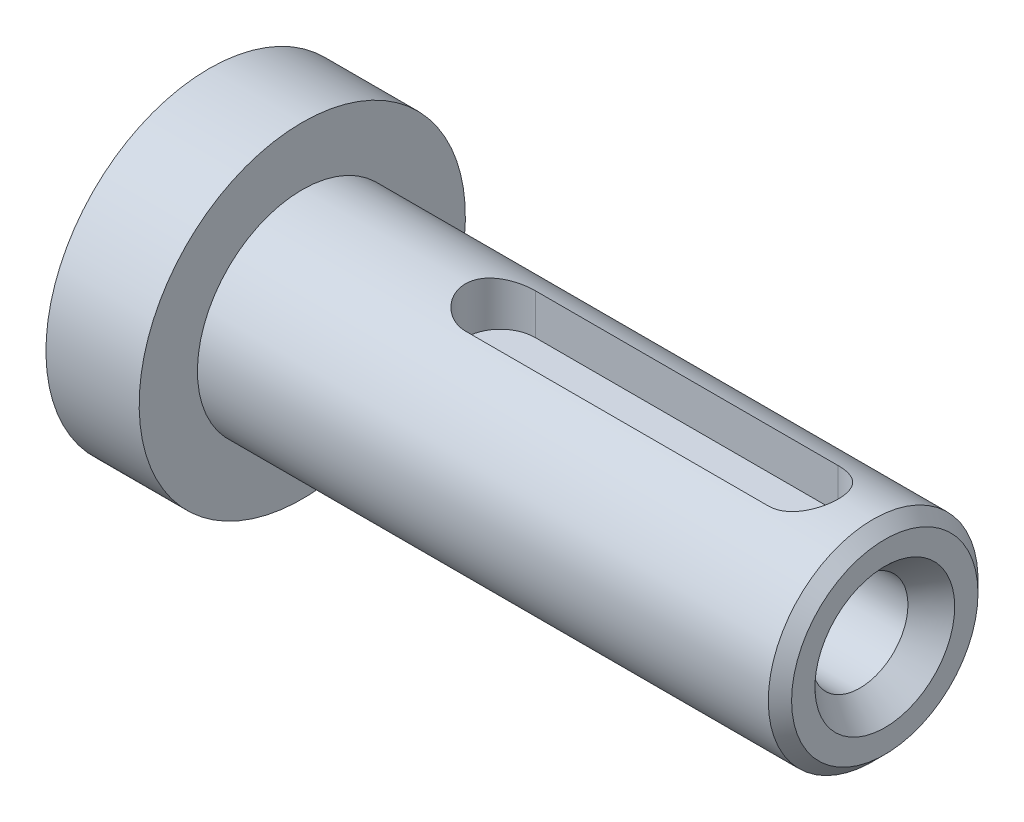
ISO-10303-21;
HEADER;
FILE_DESCRIPTION(('STEP AP214'),'2;1');
FILE_NAME('part.step','',(''),(''),'','','');
FILE_SCHEMA(('AUTOMOTIVE_DESIGN { 1 0 10303 214 1 1 1 1 }'));
ENDSEC;
DATA;
#1=APPLICATION_CONTEXT('core data for automotive mechanical design processes');
#2=APPLICATION_PROTOCOL_DEFINITION('international standard','automotive_design',2000,#1);
#3=PRODUCT_CONTEXT('',#1,'mechanical');
#4=PRODUCT('Part','Part','',(#3));
#5=PRODUCT_RELATED_PRODUCT_CATEGORY('part','',(#4));
#6=PRODUCT_DEFINITION_FORMATION('','',#4);
#7=PRODUCT_DEFINITION_CONTEXT('part definition',#1,'design');
#8=PRODUCT_DEFINITION('design','',#6,#7);
#9=PRODUCT_DEFINITION_SHAPE('','',#8);
#10=(LENGTH_UNIT() NAMED_UNIT(*) SI_UNIT(.MILLI.,.METRE.));
#11=(NAMED_UNIT(*) PLANE_ANGLE_UNIT() SI_UNIT($,.RADIAN.));
#12=(NAMED_UNIT(*) SI_UNIT($,.STERADIAN.) SOLID_ANGLE_UNIT());
#13=UNCERTAINTY_MEASURE_WITH_UNIT(LENGTH_MEASURE(1.E-05),#10,'distance_accuracy_value','');
#14=(GEOMETRIC_REPRESENTATION_CONTEXT(3) GLOBAL_UNCERTAINTY_ASSIGNED_CONTEXT((#13)) GLOBAL_UNIT_ASSIGNED_CONTEXT((#10,
#11,#12)) REPRESENTATION_CONTEXT('',''));
#15=CARTESIAN_POINT('',(0.,0.,0.));
#16=DIRECTION('',(0.,0.,1.));
#17=DIRECTION('',(1.,0.,0.));
#18=AXIS2_PLACEMENT_3D('',#15,#16,#17);
#19=CARTESIAN_POINT('',(13.9999999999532,0.,0.));
#20=DIRECTION('',(1.,0.,0.));
#21=DIRECTION('',(0.,0.,-1.));
#22=AXIS2_PLACEMENT_3D('',#19,#20,#21);
#23=CONICAL_SURFACE('',#22,2.06699999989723,1.02974425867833);
#24=CARTESIAN_POINT('',(12.7580211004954,0.,-5.6843418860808E-11));
#25=VERTEX_POINT('',#24);
#26=VERTEX_LOOP('',#25);
#27=FACE_BOUND('',#26,.T.);
#28=CARTESIAN_POINT('',(14.,0.,0.));
#29=DIRECTION('',(1.,0.,0.));
#30=DIRECTION('',(0.,1.,0.));
#31=AXIS2_PLACEMENT_3D('',#28,#29,#30);
#32=CIRCLE('',#31,2.067);
#33=CARTESIAN_POINT('',(14.,2.067,0.));
#34=VERTEX_POINT('',#33);
#35=EDGE_CURVE('E70',#34,#34,#32,.T.);
#36=ORIENTED_EDGE('',*,*,#35,.T.);
#37=EDGE_LOOP('',(#36));
#38=FACE_BOUND('',#37,.T.);
#39=ADVANCED_FACE('F16',(#27,#38),#23,.F.);
#40=CARTESIAN_POINT('',(21.5,0.,0.));
#41=DIRECTION('',(1.,0.,0.));
#42=DIRECTION('',(0.,1.,0.));
#43=AXIS2_PLACEMENT_3D('',#40,#41,#42);
#44=CYLINDRICAL_SURFACE('',#43,2.067);
#45=CARTESIAN_POINT('',(27.9267062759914,0.,0.));
#46=DIRECTION('',(1.,0.,0.));
#47=DIRECTION('',(0.,0.,-1.));
#48=AXIS2_PLACEMENT_3D('',#45,#46,#47);
#49=CIRCLE('',#48,2.06700000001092);
#50=CARTESIAN_POINT('',(27.9267062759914,0.,-2.06700000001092));
#51=VERTEX_POINT('',#50);
#52=EDGE_CURVE('E72',#51,#51,#49,.T.);
#53=ORIENTED_EDGE('',*,*,#52,.T.);
#54=EDGE_LOOP('',(#53));
#55=FACE_BOUND('',#54,.T.);
#56=ORIENTED_EDGE('',*,*,#35,.F.);
#57=EDGE_LOOP('',(#56));
#58=FACE_BOUND('',#57,.T.);
#59=ADVANCED_FACE('F66',(#55,#58),#44,.F.);
#60=CARTESIAN_POINT('',(28.9999999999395,0.,0.));
#61=DIRECTION('',(1.,0.,0.));
#62=DIRECTION('',(0.,0.,-1.));
#63=AXIS2_PLACEMENT_3D('',#60,#61,#62);
#64=CONICAL_SURFACE('',#63,2.9999999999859,0.715584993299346);
#65=CARTESIAN_POINT('',(28.9999999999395,0.,0.));
#66=DIRECTION('',(1.,0.,0.));
#67=DIRECTION('',(0.,0.,-1.));
#68=AXIS2_PLACEMENT_3D('',#65,#66,#67);
#69=CIRCLE('',#68,2.9999999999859);
#70=CARTESIAN_POINT('',(28.9999999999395,0.,-2.9999999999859));
#71=VERTEX_POINT('',#70);
#72=EDGE_CURVE('E21',#71,#71,#69,.F.);
#73=ORIENTED_EDGE('',*,*,#72,.F.);
#74=EDGE_LOOP('',(#73));
#75=FACE_BOUND('',#74,.T.);
#76=ORIENTED_EDGE('',*,*,#52,.F.);
#77=EDGE_LOOP('',(#76));
#78=FACE_BOUND('',#77,.T.);
#79=ADVANCED_FACE('F175',(#75,#78),#64,.F.);
#80=CARTESIAN_POINT('',(0.,3.5,0.));
#81=DIRECTION('',(-1.,0.,0.));
#82=DIRECTION('',(0.,-1.,0.));
#83=AXIS2_PLACEMENT_3D('',#80,#81,#82);
#84=PLANE('',#83);
#85=CARTESIAN_POINT('',(0.,0.,0.));
#86=DIRECTION('',(1.,0.,0.));
#87=DIRECTION('',(0.,1.,0.));
#88=AXIS2_PLACEMENT_3D('',#85,#86,#87);
#89=CIRCLE('',#88,7.);
#90=CARTESIAN_POINT('',(0.,7.,0.));
#91=VERTEX_POINT('',#90);
#92=EDGE_CURVE('E127',#91,#91,#89,.T.);
#93=ORIENTED_EDGE('',*,*,#92,.F.);
#94=EDGE_LOOP('',(#93));
#95=FACE_BOUND('',#94,.T.);
#96=ADVANCED_FACE('F172',(#95),#84,.T.);
#97=CARTESIAN_POINT('',(19.,2.5,0.));
#98=DIRECTION('',(0.,1.,0.));
#99=DIRECTION('',(0.,0.,1.));
#100=AXIS2_PLACEMENT_3D('',#97,#98,#99);
#101=PLANE('',#100);
#102=DIRECTION('',(1.,0.,0.));
#103=VECTOR('',#102,1.);
#104=CARTESIAN_POINT('',(12.5,2.5,1.5));
#105=LINE('',#104,#103);
#106=CARTESIAN_POINT('',(12.5,2.5,1.5));
#107=VERTEX_POINT('',#106);
#108=CARTESIAN_POINT('',(25.5,2.5,1.5));
#109=VERTEX_POINT('',#108);
#110=EDGE_CURVE('E129',#107,#109,#105,.T.);
#111=ORIENTED_EDGE('',*,*,#110,.T.);
#112=CARTESIAN_POINT('',(25.5,2.5,0.));
#113=DIRECTION('',(0.,-1.,0.));
#114=DIRECTION('',(0.,0.,-1.));
#115=AXIS2_PLACEMENT_3D('',#112,#113,#114);
#116=CIRCLE('',#115,1.5);
#117=CARTESIAN_POINT('',(25.5,2.5,-1.5));
#118=VERTEX_POINT('',#117);
#119=EDGE_CURVE('E123',#109,#118,#116,.F.);
#120=ORIENTED_EDGE('',*,*,#119,.T.);
#121=DIRECTION('',(-1.,0.,0.));
#122=VECTOR('',#121,1.);
#123=CARTESIAN_POINT('',(25.5,2.5,-1.5));
#124=LINE('',#123,#122);
#125=CARTESIAN_POINT('',(12.5,2.5,-1.5));
#126=VERTEX_POINT('',#125);
#127=EDGE_CURVE('E58',#118,#126,#124,.T.);
#128=ORIENTED_EDGE('',*,*,#127,.T.);
#129=CARTESIAN_POINT('',(12.5,2.5,0.));
#130=DIRECTION('',(0.,-1.,0.));
#131=DIRECTION('',(0.,0.,-1.));
#132=AXIS2_PLACEMENT_3D('',#129,#130,#131);
#133=CIRCLE('',#132,1.5);
#134=EDGE_CURVE('E60',#126,#107,#133,.F.);
#135=ORIENTED_EDGE('',*,*,#134,.T.);
#136=EDGE_LOOP('',(#111,#120,#128,#135));
#137=FACE_BOUND('',#136,.T.);
#138=ADVANCED_FACE('F153',(#137),#101,.T.);
#139=CARTESIAN_POINT('',(29.,2.25000000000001,0.));
#140=DIRECTION('',(1.,0.,0.));
#141=DIRECTION('',(0.,0.,-1.));
#142=AXIS2_PLACEMENT_3D('',#139,#140,#141);
#143=PLANE('',#142);
#144=CARTESIAN_POINT('',(28.9999999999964,0.,0.));
#145=DIRECTION('',(-1.,0.,0.));
#146=DIRECTION('',(0.,0.,1.));
#147=AXIS2_PLACEMENT_3D('',#144,#145,#146);
#148=CIRCLE('',#147,4.0000000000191);
#149=CARTESIAN_POINT('',(28.9999999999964,0.,4.0000000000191));
#150=VERTEX_POINT('',#149);
#151=EDGE_CURVE('E118',#150,#150,#148,.T.);
#152=ORIENTED_EDGE('',*,*,#151,.F.);
#153=EDGE_LOOP('',(#152));
#154=FACE_BOUND('',#153,.T.);
#155=ORIENTED_EDGE('',*,*,#72,.T.);
#156=EDGE_LOOP('',(#155));
#157=FACE_BOUND('',#156,.T.);
#158=ADVANCED_FACE('F166',(#154,#157),#143,.T.);
#159=CARTESIAN_POINT('',(12.5,4.5,1.5));
#160=DIRECTION('',(0.,0.,1.));
#161=DIRECTION('',(0.,-1.,0.));
#162=AXIS2_PLACEMENT_3D('',#159,#160,#161);
#163=PLANE('',#162);
#164=DIRECTION('',(0.,-1.,0.));
#165=VECTOR('',#164,1.);
#166=CARTESIAN_POINT('',(25.5,4.5,1.5));
#167=LINE('',#166,#165);
#168=CARTESIAN_POINT('',(25.5,4.24264068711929,1.5));
#169=VERTEX_POINT('',#168);
#170=EDGE_CURVE('E125',#169,#109,#167,.T.);
#171=ORIENTED_EDGE('',*,*,#170,.T.);
#172=ORIENTED_EDGE('',*,*,#110,.F.);
#173=DIRECTION('',(0.,-1.,0.));
#174=VECTOR('',#173,1.);
#175=CARTESIAN_POINT('',(12.5,4.5,1.5));
#176=LINE('',#175,#174);
#177=CARTESIAN_POINT('',(12.5,4.24264068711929,1.5));
#178=VERTEX_POINT('',#177);
#179=EDGE_CURVE('E126',#107,#178,#176,.F.);
#180=ORIENTED_EDGE('',*,*,#179,.T.);
#181=DIRECTION('',(1.,0.,0.));
#182=VECTOR('',#181,1.);
#183=CARTESIAN_POINT('',(16.5,4.24264068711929,1.5));
#184=LINE('',#183,#182);
#185=EDGE_CURVE('E115',#169,#178,#184,.F.);
#186=ORIENTED_EDGE('',*,*,#185,.F.);
#187=EDGE_LOOP('',(#171,#172,#180,#186));
#188=FACE_BOUND('',#187,.T.);
#189=ADVANCED_FACE('F148',(#188),#163,.F.);
#190=CARTESIAN_POINT('',(2.,0.,0.));
#191=DIRECTION('',(1.,0.,0.));
#192=DIRECTION('',(0.,1.,0.));
#193=AXIS2_PLACEMENT_3D('',#190,#191,#192);
#194=CYLINDRICAL_SURFACE('',#193,7.);
#195=CARTESIAN_POINT('',(4.,0.,0.));
#196=DIRECTION('',(1.,0.,0.));
#197=DIRECTION('',(0.,1.,0.));
#198=AXIS2_PLACEMENT_3D('',#195,#196,#197);
#199=CIRCLE('',#198,7.);
#200=CARTESIAN_POINT('',(4.,7.,0.));
#201=VERTEX_POINT('',#200);
#202=EDGE_CURVE('E111',#201,#201,#199,.T.);
#203=ORIENTED_EDGE('',*,*,#202,.F.);
#204=EDGE_LOOP('',(#203));
#205=FACE_BOUND('',#204,.T.);
#206=ORIENTED_EDGE('',*,*,#92,.T.);
#207=EDGE_LOOP('',(#206));
#208=FACE_BOUND('',#207,.T.);
#209=ADVANCED_FACE('F157',(#205,#208),#194,.T.);
#210=CARTESIAN_POINT('',(12.5,4.5,0.));
#211=DIRECTION('',(0.,-1.,0.));
#212=DIRECTION('',(0.,0.,-1.));
#213=AXIS2_PLACEMENT_3D('',#210,#211,#212);
#214=CYLINDRICAL_SURFACE('',#213,1.5);
#215=CARTESIAN_POINT('',(12.5,4.24264068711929,1.5));
#216=CARTESIAN_POINT('',(12.459064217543,4.24263663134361,1.50000112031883));
#217=CARTESIAN_POINT('',(12.4181493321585,4.24323390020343,1.49832318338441));
#218=CARTESIAN_POINT('',(12.3366369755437,4.24558991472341,1.49163839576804));
#219=CARTESIAN_POINT('',(12.2960394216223,4.24734834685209,1.48663244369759));
#220=CARTESIAN_POINT('',(12.175411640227,4.25428639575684,1.46671597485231));
#221=CARTESIAN_POINT('',(12.0962286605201,4.26112939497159,1.4469063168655));
#222=CARTESIAN_POINT('',(11.9425611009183,4.27842124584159,1.39493725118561));
#223=CARTESIAN_POINT('',(11.8680740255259,4.28886816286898,1.36278446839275));
#224=CARTESIAN_POINT('',(11.7254882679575,4.31218218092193,1.28710854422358));
#225=CARTESIAN_POINT('',(11.6573933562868,4.32505069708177,1.24357874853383));
#226=CARTESIAN_POINT('',(11.5269254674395,4.35231599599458,1.14458163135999));
#227=CARTESIAN_POINT('',(11.4648385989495,4.36675064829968,1.08874777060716));
#228=CARTESIAN_POINT('',(11.3507000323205,4.39520526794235,0.967493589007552));
#229=CARTESIAN_POINT('',(11.2986518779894,4.40922508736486,0.902069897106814));
#230=CARTESIAN_POINT('',(11.2047588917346,4.43571449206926,0.761374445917));
#231=CARTESIAN_POINT('',(11.1632208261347,4.44813318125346,0.685887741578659));
#232=CARTESIAN_POINT('',(11.0935845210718,4.46955244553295,0.528559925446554));
#233=CARTESIAN_POINT('',(11.0654697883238,4.47855721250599,0.446726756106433));
#234=CARTESIAN_POINT('',(11.0298143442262,4.49012907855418,0.303780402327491));
#235=CARTESIAN_POINT('',(11.0186570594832,4.49380993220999,0.243634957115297));
#236=CARTESIAN_POINT('',(11.0037488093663,4.4987462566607,0.122333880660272));
#237=CARTESIAN_POINT('',(10.999997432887,4.50000186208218,0.0611783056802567));
#238=CARTESIAN_POINT('',(11.0000034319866,4.49999751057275,-0.0817895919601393));
#239=CARTESIAN_POINT('',(11.0067163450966,4.49774753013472,-0.163619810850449));
#240=CARTESIAN_POINT('',(11.0333277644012,4.48898373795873,-0.324909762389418));
#241=CARTESIAN_POINT('',(11.0532374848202,4.48246629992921,-0.404367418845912));
#242=CARTESIAN_POINT('',(11.1054806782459,4.4658789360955,-0.558502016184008));
#243=CARTESIAN_POINT('',(11.1377894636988,4.45581607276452,-0.63318811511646));
#244=CARTESIAN_POINT('',(11.213816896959,4.43316524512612,-0.77607095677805));
#245=CARTESIAN_POINT('',(11.2575364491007,4.42057708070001,-0.844267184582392));
#246=CARTESIAN_POINT('',(11.3567371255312,4.39371181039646,-0.974610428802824));
#247=CARTESIAN_POINT('',(11.412543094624,4.37939421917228,-1.03650182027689));
#248=CARTESIAN_POINT('',(11.5336474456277,4.35090550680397,-1.15024615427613));
#249=CARTESIAN_POINT('',(11.5989484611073,4.33673442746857,-1.20209630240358));
#250=CARTESIAN_POINT('',(11.7395008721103,4.30969530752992,-1.29575381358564));
#251=CARTESIAN_POINT('',(11.8149864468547,4.29687715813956,-1.33722519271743));
#252=CARTESIAN_POINT('',(11.9723298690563,4.27462222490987,-1.40674971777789));
#253=CARTESIAN_POINT('',(12.0541811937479,4.26518203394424,-1.43481639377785));
#254=CARTESIAN_POINT('',(12.19699794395,4.25304078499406,-1.47033712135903));
#255=CARTESIAN_POINT('',(12.2569820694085,4.24917238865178,-1.48143226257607));
#256=CARTESIAN_POINT('',(12.3779634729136,4.24395805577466,-1.49627411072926));
#257=CARTESIAN_POINT('',(12.4389608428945,4.2426123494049,-1.5000201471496));
#258=CARTESIAN_POINT('',(12.5,4.24264068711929,-1.5));
#259=B_SPLINE_CURVE_WITH_KNOTS('',3,(#215,#216,#217,#218,#219,#220,#221,#222,#223,#224,#225,
#226,#227,#228,#229,#230,#231,#232,#233,#234,#235,#236,#237,#238,#239,#240,#241,#242,#243,#244,
#245,#246,#247,#248,#249,#250,#251,#252,#253,#254,#255,#256,#257,#258),.UNSPECIFIED.,.F.,.F.,(4,
2,2,2,2,2,2,2,2,2,2,2,2,2,2,2,2,2,2,2,2,4),(0.,0.122727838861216,0.245422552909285,
0.489871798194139,0.734190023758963,0.978651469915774,1.23172549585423,1.48488869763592,
1.74475735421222,2.0043058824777,2.18767918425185,2.37104230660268,2.61618140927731,
2.86152909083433,3.10639077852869,3.35127187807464,3.60380525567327,3.85640881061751,
4.11635987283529,4.37604799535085,4.55894346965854,4.7418556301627),.UNSPECIFIED.);
#260=CARTESIAN_POINT('',(12.5,4.24264068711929,-1.5));
#261=VERTEX_POINT('',#260);
#262=EDGE_CURVE('E85',#178,#261,#259,.T.);
#263=ORIENTED_EDGE('',*,*,#262,.F.);
#264=ORIENTED_EDGE('',*,*,#179,.F.);
#265=ORIENTED_EDGE('',*,*,#134,.F.);
#266=DIRECTION('',(0.,1.,0.));
#267=VECTOR('',#266,1.);
#268=CARTESIAN_POINT('',(12.5,4.5,-1.5));
#269=LINE('',#268,#267);
#270=EDGE_CURVE('E136',#126,#261,#269,.T.);
#271=ORIENTED_EDGE('',*,*,#270,.T.);
#272=EDGE_LOOP('',(#263,#264,#265,#271));
#273=FACE_BOUND('',#272,.T.);
#274=ADVANCED_FACE('F155',(#273),#214,.F.);
#275=CARTESIAN_POINT('',(25.5,4.5,-1.5));
#276=DIRECTION('',(0.,0.,-1.));
#277=DIRECTION('',(-1.,0.,0.));
#278=AXIS2_PLACEMENT_3D('',#275,#276,#277);
#279=PLANE('',#278);
#280=ORIENTED_EDGE('',*,*,#270,.F.);
#281=ORIENTED_EDGE('',*,*,#127,.F.);
#282=DIRECTION('',(0.,-1.,0.));
#283=VECTOR('',#282,1.);
#284=CARTESIAN_POINT('',(25.5,4.5,-1.5));
#285=LINE('',#284,#283);
#286=CARTESIAN_POINT('',(25.5,4.24264068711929,-1.5));
#287=VERTEX_POINT('',#286);
#288=EDGE_CURVE('E36',#118,#287,#285,.F.);
#289=ORIENTED_EDGE('',*,*,#288,.T.);
#290=DIRECTION('',(1.,0.,0.));
#291=VECTOR('',#290,1.);
#292=CARTESIAN_POINT('',(16.5,4.24264068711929,-1.5));
#293=LINE('',#292,#291);
#294=EDGE_CURVE('E84',#261,#287,#293,.T.);
#295=ORIENTED_EDGE('',*,*,#294,.F.);
#296=EDGE_LOOP('',(#280,#281,#289,#295));
#297=FACE_BOUND('',#296,.T.);
#298=ADVANCED_FACE('F97',(#297),#279,.F.);
#299=CARTESIAN_POINT('',(25.5,4.5,0.));
#300=DIRECTION('',(0.,-1.,0.));
#301=DIRECTION('',(0.,0.,-1.));
#302=AXIS2_PLACEMENT_3D('',#299,#300,#301);
#303=CYLINDRICAL_SURFACE('',#302,1.5);
#304=ORIENTED_EDGE('',*,*,#288,.F.);
#305=ORIENTED_EDGE('',*,*,#119,.F.);
#306=ORIENTED_EDGE('',*,*,#170,.F.);
#307=CARTESIAN_POINT('',(25.5,4.24264068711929,-1.5));
#308=CARTESIAN_POINT('',(25.540935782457,4.24263663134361,-1.50000112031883));
#309=CARTESIAN_POINT('',(25.5818506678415,4.24323390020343,-1.49832318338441));
#310=CARTESIAN_POINT('',(25.6633630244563,4.24558991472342,-1.49163839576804));
#311=CARTESIAN_POINT('',(25.7039605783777,4.24734834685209,-1.48663244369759));
#312=CARTESIAN_POINT('',(25.824588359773,4.25428639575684,-1.46671597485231));
#313=CARTESIAN_POINT('',(25.9037713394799,4.2611293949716,-1.4469063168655));
#314=CARTESIAN_POINT('',(26.0574388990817,4.27842124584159,-1.39493725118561));
#315=CARTESIAN_POINT('',(26.1319259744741,4.28886816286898,-1.36278446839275));
#316=CARTESIAN_POINT('',(26.2745117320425,4.31218218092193,-1.28710854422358));
#317=CARTESIAN_POINT('',(26.3426066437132,4.32505069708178,-1.24357874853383));
#318=CARTESIAN_POINT('',(26.4730745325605,4.35231599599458,-1.14458163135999));
#319=CARTESIAN_POINT('',(26.5351614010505,4.36675064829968,-1.08874777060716));
#320=CARTESIAN_POINT('',(26.6492999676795,4.39520526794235,-0.967493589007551));
#321=CARTESIAN_POINT('',(26.7013481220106,4.40922508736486,-0.902069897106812));
#322=CARTESIAN_POINT('',(26.7952411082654,4.43571449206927,-0.761374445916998));
#323=CARTESIAN_POINT('',(26.8367791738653,4.44813318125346,-0.685887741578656));
#324=CARTESIAN_POINT('',(26.9064154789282,4.46955244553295,-0.528559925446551));
#325=CARTESIAN_POINT('',(26.9345302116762,4.47855721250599,-0.44672675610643));
#326=CARTESIAN_POINT('',(26.9701856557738,4.49012907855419,-0.303780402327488));
#327=CARTESIAN_POINT('',(26.9813429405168,4.49380993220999,-0.243634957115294));
#328=CARTESIAN_POINT('',(26.9962511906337,4.4987462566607,-0.122333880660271));
#329=CARTESIAN_POINT('',(27.000002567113,4.50000186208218,-0.0611783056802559));
#330=CARTESIAN_POINT('',(26.9999965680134,4.49999751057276,0.0817895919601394));
#331=CARTESIAN_POINT('',(26.9932836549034,4.49774753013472,0.163619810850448));
#332=CARTESIAN_POINT('',(26.9666722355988,4.48898373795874,0.324909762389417));
#333=CARTESIAN_POINT('',(26.9467625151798,4.48246629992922,0.404367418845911));
#334=CARTESIAN_POINT('',(26.8945193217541,4.4658789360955,0.558502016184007));
#335=CARTESIAN_POINT('',(26.8622105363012,4.45581607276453,0.633188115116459));
#336=CARTESIAN_POINT('',(26.786183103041,4.43316524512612,0.776070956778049));
#337=CARTESIAN_POINT('',(26.7424635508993,4.42057708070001,0.844267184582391));
#338=CARTESIAN_POINT('',(26.6432628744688,4.39371181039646,0.974610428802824));
#339=CARTESIAN_POINT('',(26.587456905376,4.37939421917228,1.03650182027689));
#340=CARTESIAN_POINT('',(26.4663525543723,4.35090550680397,1.15024615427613));
#341=CARTESIAN_POINT('',(26.4010515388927,4.33673442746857,1.20209630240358));
#342=CARTESIAN_POINT('',(26.2604991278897,4.30969530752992,1.29575381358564));
#343=CARTESIAN_POINT('',(26.1850135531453,4.29687715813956,1.33722519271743));
#344=CARTESIAN_POINT('',(26.0276701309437,4.27462222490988,1.4067497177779));
#345=CARTESIAN_POINT('',(25.9458188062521,4.26518203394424,1.43481639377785));
#346=CARTESIAN_POINT('',(25.80300205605,4.25304078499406,1.47033712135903));
#347=CARTESIAN_POINT('',(25.7430179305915,4.24917238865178,1.48143226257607));
#348=CARTESIAN_POINT('',(25.6220365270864,4.24395805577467,1.49627411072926));
#349=CARTESIAN_POINT('',(25.5610391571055,4.24261234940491,1.5000201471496));
#350=CARTESIAN_POINT('',(25.5,4.24264068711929,1.5));
#351=B_SPLINE_CURVE_WITH_KNOTS('',3,(#307,#308,#309,#310,#311,#312,#313,#314,#315,#316,#317,
#318,#319,#320,#321,#322,#323,#324,#325,#326,#327,#328,#329,#330,#331,#332,#333,#334,#335,#336,
#337,#338,#339,#340,#341,#342,#343,#344,#345,#346,#347,#348,#349,#350),.UNSPECIFIED.,.F.,.F.,(4,
2,2,2,2,2,2,2,2,2,2,2,2,2,2,2,2,2,2,2,2,4),(0.,0.122727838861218,0.245422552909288,
0.489871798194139,0.734190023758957,0.978651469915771,1.23172549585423,1.48488869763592,
1.74475735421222,2.0043058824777,2.18767918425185,2.37104230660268,2.6161814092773,
2.86152909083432,3.10639077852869,3.35127187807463,3.60380525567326,3.85640881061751,
4.11635987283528,4.37604799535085,4.55894346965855,4.7418556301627),.UNSPECIFIED.);
#352=EDGE_CURVE('E78',#287,#169,#351,.T.);
#353=ORIENTED_EDGE('',*,*,#352,.F.);
#354=EDGE_LOOP('',(#304,#305,#306,#353));
#355=FACE_BOUND('',#354,.T.);
#356=ADVANCED_FACE('F91',(#355),#303,.F.);
#357=CARTESIAN_POINT('',(28.500000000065,0.,0.));
#358=DIRECTION('',(-1.,0.,0.));
#359=DIRECTION('',(0.,0.,1.));
#360=AXIS2_PLACEMENT_3D('',#357,#358,#359);
#361=CONICAL_SURFACE('',#360,4.49999999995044,0.785398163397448);
#362=CARTESIAN_POINT('',(28.5,0.,0.));
#363=DIRECTION('',(1.,0.,0.));
#364=DIRECTION('',(0.,1.,0.));
#365=AXIS2_PLACEMENT_3D('',#362,#363,#364);
#366=CIRCLE('',#365,4.5);
#367=CARTESIAN_POINT('',(28.5,4.50000000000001,0.));
#368=VERTEX_POINT('',#367);
#369=EDGE_CURVE('E27',#368,#368,#366,.F.);
#370=ORIENTED_EDGE('',*,*,#369,.F.);
#371=EDGE_LOOP('',(#370));
#372=FACE_BOUND('',#371,.T.);
#373=ORIENTED_EDGE('',*,*,#151,.T.);
#374=EDGE_LOOP('',(#373));
#375=FACE_BOUND('',#374,.T.);
#376=ADVANCED_FACE('F96',(#372,#375),#361,.T.);
#377=CARTESIAN_POINT('',(4.,5.75,0.));
#378=DIRECTION('',(1.,0.,0.));
#379=DIRECTION('',(0.,0.,-1.));
#380=AXIS2_PLACEMENT_3D('',#377,#378,#379);
#381=PLANE('',#380);
#382=ORIENTED_EDGE('',*,*,#202,.T.);
#383=EDGE_LOOP('',(#382));
#384=FACE_BOUND('',#383,.T.);
#385=CARTESIAN_POINT('',(4.,0.,0.));
#386=DIRECTION('',(1.,0.,0.));
#387=DIRECTION('',(0.,1.,0.));
#388=AXIS2_PLACEMENT_3D('',#385,#386,#387);
#389=CIRCLE('',#388,4.5);
#390=CARTESIAN_POINT('',(4.,4.5,0.));
#391=VERTEX_POINT('',#390);
#392=EDGE_CURVE('E10',#391,#391,#389,.T.);
#393=ORIENTED_EDGE('',*,*,#392,.F.);
#394=EDGE_LOOP('',(#393));
#395=FACE_BOUND('',#394,.T.);
#396=ADVANCED_FACE('F100',(#384,#395),#381,.T.);
#397=CARTESIAN_POINT('',(16.5,0.,0.));
#398=DIRECTION('',(1.,0.,0.));
#399=DIRECTION('',(0.,1.,0.));
#400=AXIS2_PLACEMENT_3D('',#397,#398,#399);
#401=CYLINDRICAL_SURFACE('',#400,4.5);
#402=ORIENTED_EDGE('',*,*,#185,.T.);
#403=ORIENTED_EDGE('',*,*,#262,.T.);
#404=ORIENTED_EDGE('',*,*,#294,.T.);
#405=ORIENTED_EDGE('',*,*,#352,.T.);
#406=EDGE_LOOP('',(#402,#403,#404,#405));
#407=FACE_BOUND('',#406,.T.);
#408=ORIENTED_EDGE('',*,*,#369,.T.);
#409=EDGE_LOOP('',(#408));
#410=FACE_BOUND('',#409,.T.);
#411=ORIENTED_EDGE('',*,*,#392,.T.);
#412=EDGE_LOOP('',(#411));
#413=FACE_BOUND('',#412,.T.);
#414=ADVANCED_FACE('F18',(#407,#410,#413),#401,.T.);
#415=CLOSED_SHELL('',(#39,#59,#79,#96,#138,#158,#189,#209,#274,#298,#356,#376,#396,#414));
#416=MANIFOLD_SOLID_BREP('B1',#415);
#417=ADVANCED_BREP_SHAPE_REPRESENTATION('',(#18,#416),#14);
#418=SHAPE_DEFINITION_REPRESENTATION(#9,#417);
ENDSEC;
END-ISO-10303-21;
